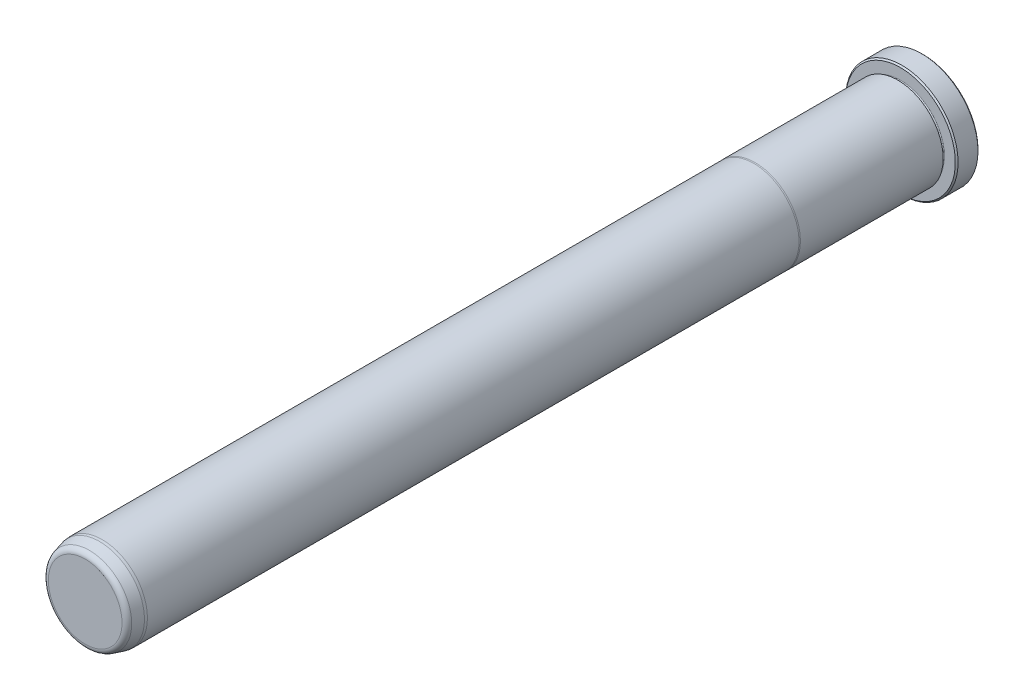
ISO-10303-21;
HEADER;
FILE_DESCRIPTION(('STEP AP214'),'2;1');
FILE_NAME('part.step','',(''),(''),'','','');
FILE_SCHEMA(('AUTOMOTIVE_DESIGN { 1 0 10303 214 1 1 1 1 }'));
ENDSEC;
DATA;
#1=APPLICATION_CONTEXT('core data for automotive mechanical design processes');
#2=APPLICATION_PROTOCOL_DEFINITION('international standard','automotive_design',2000,#1);
#3=PRODUCT_CONTEXT('',#1,'mechanical');
#4=PRODUCT('Part','Part','',(#3));
#5=PRODUCT_RELATED_PRODUCT_CATEGORY('part','',(#4));
#6=PRODUCT_DEFINITION_FORMATION('','',#4);
#7=PRODUCT_DEFINITION_CONTEXT('part definition',#1,'design');
#8=PRODUCT_DEFINITION('design','',#6,#7);
#9=PRODUCT_DEFINITION_SHAPE('','',#8);
#10=(LENGTH_UNIT() NAMED_UNIT(*) SI_UNIT(.MILLI.,.METRE.));
#11=(NAMED_UNIT(*) PLANE_ANGLE_UNIT() SI_UNIT($,.RADIAN.));
#12=(NAMED_UNIT(*) SI_UNIT($,.STERADIAN.) SOLID_ANGLE_UNIT());
#13=UNCERTAINTY_MEASURE_WITH_UNIT(LENGTH_MEASURE(1.E-05),#10,'distance_accuracy_value','');
#14=(GEOMETRIC_REPRESENTATION_CONTEXT(3) GLOBAL_UNCERTAINTY_ASSIGNED_CONTEXT((#13)) GLOBAL_UNIT_ASSIGNED_CONTEXT((#10,
#11,#12)) REPRESENTATION_CONTEXT('',''));
#15=CARTESIAN_POINT('',(0.,0.,0.));
#16=DIRECTION('',(0.,0.,1.));
#17=DIRECTION('',(1.,0.,0.));
#18=AXIS2_PLACEMENT_3D('',#15,#16,#17);
#19=CARTESIAN_POINT('',(0.,0.,0.));
#20=DIRECTION('',(0.,0.,1.));
#21=DIRECTION('',(1.,0.,0.));
#22=AXIS2_PLACEMENT_3D('',#19,#20,#21);
#23=PLANE('',#22);
#24=CARTESIAN_POINT('',(0.,0.,0.));
#25=DIRECTION('',(0.,0.,1.));
#26=DIRECTION('',(1.,0.,0.));
#27=AXIS2_PLACEMENT_3D('',#24,#25,#26);
#28=CIRCLE('',#27,15.367);
#29=CARTESIAN_POINT('',(15.367,0.,0.));
#30=VERTEX_POINT('',#29);
#31=EDGE_CURVE('E37',#30,#30,#28,.F.);
#32=ORIENTED_EDGE('',*,*,#31,.T.);
#33=EDGE_LOOP('',(#32));
#34=FACE_BOUND('',#33,.T.);
#35=ADVANCED_FACE('F30',(#34),#23,.F.);
#36=CARTESIAN_POINT('',(0.,0.,0.));
#37=DIRECTION('',(0.,0.,1.));
#38=DIRECTION('',(1.,0.,0.));
#39=AXIS2_PLACEMENT_3D('',#36,#37,#38);
#40=CYLINDRICAL_SURFACE('',#39,15.748);
#41=CARTESIAN_POINT('',(0.,0.,0.381000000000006));
#42=DIRECTION('',(0.,0.,1.));
#43=DIRECTION('',(1.,0.,0.));
#44=AXIS2_PLACEMENT_3D('',#41,#42,#43);
#45=CIRCLE('',#44,15.748);
#46=CARTESIAN_POINT('',(15.748,0.,0.381000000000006));
#47=VERTEX_POINT('',#46);
#48=EDGE_CURVE('E41',#47,#47,#45,.T.);
#49=ORIENTED_EDGE('',*,*,#48,.T.);
#50=EDGE_LOOP('',(#49));
#51=FACE_BOUND('',#50,.T.);
#52=CARTESIAN_POINT('',(0.,0.,5.96900000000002));
#53=DIRECTION('',(0.,0.,-1.));
#54=DIRECTION('',(-1.,0.,0.));
#55=AXIS2_PLACEMENT_3D('',#52,#53,#54);
#56=CIRCLE('',#55,15.748);
#57=CARTESIAN_POINT('',(-15.748,0.,5.96900000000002));
#58=VERTEX_POINT('',#57);
#59=EDGE_CURVE('E45',#58,#58,#56,.T.);
#60=ORIENTED_EDGE('',*,*,#59,.T.);
#61=EDGE_LOOP('',(#60));
#62=FACE_BOUND('',#61,.T.);
#63=ADVANCED_FACE('F118',(#51,#62),#40,.T.);
#64=CARTESIAN_POINT('',(0.,15.748,6.35));
#65=DIRECTION('',(0.,0.,-1.));
#66=DIRECTION('',(-1.,0.,0.));
#67=AXIS2_PLACEMENT_3D('',#64,#65,#66);
#68=PLANE('',#67);
#69=CARTESIAN_POINT('',(0.,0.,6.35));
#70=DIRECTION('',(0.,0.,-1.));
#71=DIRECTION('',(-1.,0.,0.));
#72=AXIS2_PLACEMENT_3D('',#69,#70,#71);
#73=CIRCLE('',#72,15.367);
#74=CARTESIAN_POINT('',(-15.367,0.,6.35));
#75=VERTEX_POINT('',#74);
#76=EDGE_CURVE('E10',#75,#75,#73,.F.);
#77=ORIENTED_EDGE('',*,*,#76,.T.);
#78=EDGE_LOOP('',(#77));
#79=FACE_BOUND('',#78,.T.);
#80=CARTESIAN_POINT('',(0.,0.,6.35));
#81=DIRECTION('',(0.,0.,1.));
#82=DIRECTION('',(1.,0.,0.));
#83=AXIS2_PLACEMENT_3D('',#80,#81,#82);
#84=CIRCLE('',#83,12.3063);
#85=CARTESIAN_POINT('',(12.3063,0.,6.35));
#86=VERTEX_POINT('',#85);
#87=EDGE_CURVE('E56',#86,#86,#84,.T.);
#88=ORIENTED_EDGE('',*,*,#87,.F.);
#89=EDGE_LOOP('',(#88));
#90=FACE_BOUND('',#89,.T.);
#91=ADVANCED_FACE('F113',(#79,#90),#68,.F.);
#92=CARTESIAN_POINT('',(0.,0.,6.731));
#93=DIRECTION('',(0.,0.,1.));
#94=DIRECTION('',(1.,0.,0.));
#95=AXIS2_PLACEMENT_3D('',#92,#93,#94);
#96=TOROIDAL_SURFACE('',#95,12.3063,0.381);
#97=CARTESIAN_POINT('',(0.,0.,7.112));
#98=DIRECTION('',(0.,0.,1.));
#99=DIRECTION('',(1.,0.,0.));
#100=AXIS2_PLACEMENT_3D('',#97,#98,#99);
#101=CIRCLE('',#100,12.3063);
#102=CARTESIAN_POINT('',(12.3063,0.,7.112));
#103=VERTEX_POINT('',#102);
#104=EDGE_CURVE('E59',#103,#103,#101,.T.);
#105=ORIENTED_EDGE('',*,*,#104,.F.);
#106=EDGE_LOOP('',(#105));
#107=FACE_BOUND('',#106,.T.);
#108=ORIENTED_EDGE('',*,*,#87,.T.);
#109=EDGE_LOOP('',(#108));
#110=FACE_BOUND('',#109,.T.);
#111=ADVANCED_FACE('F107',(#107,#110),#96,.F.);
#112=CARTESIAN_POINT('',(0.,12.3063,7.112));
#113=DIRECTION('',(0.,0.,1.));
#114=DIRECTION('',(1.,0.,0.));
#115=AXIS2_PLACEMENT_3D('',#112,#113,#114);
#116=PLANE('',#115);
#117=CARTESIAN_POINT('',(0.,0.,7.112));
#118=DIRECTION('',(0.,0.,1.));
#119=DIRECTION('',(1.,0.,0.));
#120=AXIS2_PLACEMENT_3D('',#117,#118,#119);
#121=CIRCLE('',#120,12.7127);
#122=CARTESIAN_POINT('',(12.7127,0.,7.112));
#123=VERTEX_POINT('',#122);
#124=EDGE_CURVE('E62',#123,#123,#121,.T.);
#125=ORIENTED_EDGE('',*,*,#124,.F.);
#126=EDGE_LOOP('',(#125));
#127=FACE_BOUND('',#126,.T.);
#128=ORIENTED_EDGE('',*,*,#104,.T.);
#129=EDGE_LOOP('',(#128));
#130=FACE_BOUND('',#129,.T.);
#131=ADVANCED_FACE('F101',(#127,#130),#116,.F.);
#132=CARTESIAN_POINT('',(0.,0.,0.));
#133=DIRECTION('',(0.,0.,1.));
#134=DIRECTION('',(1.,0.,0.));
#135=AXIS2_PLACEMENT_3D('',#132,#133,#134);
#136=CYLINDRICAL_SURFACE('',#135,12.7127);
#137=CARTESIAN_POINT('',(0.,0.,47.1347630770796));
#138=DIRECTION('',(0.,0.,1.));
#139=DIRECTION('',(1.,0.,0.));
#140=AXIS2_PLACEMENT_3D('',#137,#138,#139);
#141=CIRCLE('',#140,12.7127);
#142=CARTESIAN_POINT('',(12.7127,0.,47.1347630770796));
#143=VERTEX_POINT('',#142);
#144=EDGE_CURVE('E65',#143,#143,#141,.T.);
#145=ORIENTED_EDGE('',*,*,#144,.F.);
#146=EDGE_LOOP('',(#145));
#147=FACE_BOUND('',#146,.T.);
#148=ORIENTED_EDGE('',*,*,#124,.T.);
#149=EDGE_LOOP('',(#148));
#150=FACE_BOUND('',#149,.T.);
#151=ADVANCED_FACE('F95',(#147,#150),#136,.T.);
#152=CARTESIAN_POINT('',(0.,0.,47.1347630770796));
#153=DIRECTION('',(0.,0.,-1.));
#154=DIRECTION('',(-1.,0.,0.));
#155=AXIS2_PLACEMENT_3D('',#152,#153,#154);
#156=CONICAL_SURFACE('',#155,12.7127,0.0698131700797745);
#157=CARTESIAN_POINT('',(0.,0.,47.498));
#158=DIRECTION('',(0.,0.,1.));
#159=DIRECTION('',(1.,0.,0.));
#160=AXIS2_PLACEMENT_3D('',#157,#158,#159);
#161=CIRCLE('',#160,12.6873);
#162=CARTESIAN_POINT('',(12.6873,0.,47.498));
#163=VERTEX_POINT('',#162);
#164=EDGE_CURVE('E68',#163,#163,#161,.T.);
#165=ORIENTED_EDGE('',*,*,#164,.F.);
#166=EDGE_LOOP('',(#165));
#167=FACE_BOUND('',#166,.T.);
#168=ORIENTED_EDGE('',*,*,#144,.T.);
#169=EDGE_LOOP('',(#168));
#170=FACE_BOUND('',#169,.T.);
#171=ADVANCED_FACE('F89',(#167,#170),#156,.T.);
#172=CARTESIAN_POINT('',(0.,0.,0.));
#173=DIRECTION('',(0.,0.,1.));
#174=DIRECTION('',(1.,0.,0.));
#175=AXIS2_PLACEMENT_3D('',#172,#173,#174);
#176=CYLINDRICAL_SURFACE('',#175,12.6873);
#177=CARTESIAN_POINT('',(0.,0.,230.1875));
#178=DIRECTION('',(0.,0.,1.));
#179=DIRECTION('',(1.,0.,0.));
#180=AXIS2_PLACEMENT_3D('',#177,#178,#179);
#181=CIRCLE('',#180,12.6873);
#182=CARTESIAN_POINT('',(12.6873,0.,230.1875));
#183=VERTEX_POINT('',#182);
#184=EDGE_CURVE('E71',#183,#183,#181,.T.);
#185=ORIENTED_EDGE('',*,*,#184,.F.);
#186=EDGE_LOOP('',(#185));
#187=FACE_BOUND('',#186,.T.);
#188=ORIENTED_EDGE('',*,*,#164,.T.);
#189=EDGE_LOOP('',(#188));
#190=FACE_BOUND('',#189,.T.);
#191=ADVANCED_FACE('F83',(#187,#190),#176,.T.);
#192=CARTESIAN_POINT('',(0.,0.,230.1875));
#193=DIRECTION('',(0.,0.,-1.));
#194=DIRECTION('',(-1.,0.,0.));
#195=AXIS2_PLACEMENT_3D('',#192,#193,#194);
#196=CONICAL_SURFACE('',#195,12.6873,0.0872664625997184);
#197=CARTESIAN_POINT('',(0.,0.,230.9495));
#198=DIRECTION('',(0.,0.,1.));
#199=DIRECTION('',(1.,0.,0.));
#200=AXIS2_PLACEMENT_3D('',#197,#198,#199);
#201=CIRCLE('',#200,12.6206336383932);
#202=CARTESIAN_POINT('',(12.6206336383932,0.,230.9495));
#203=VERTEX_POINT('',#202);
#204=EDGE_CURVE('E74',#203,#203,#201,.T.);
#205=ORIENTED_EDGE('',*,*,#204,.F.);
#206=EDGE_LOOP('',(#205));
#207=FACE_BOUND('',#206,.T.);
#208=ORIENTED_EDGE('',*,*,#184,.T.);
#209=EDGE_LOOP('',(#208));
#210=FACE_BOUND('',#209,.T.);
#211=ADVANCED_FACE('F80',(#207,#210),#196,.T.);
#212=CARTESIAN_POINT('',(0.,0.,230.9495));
#213=DIRECTION('',(0.,0.,-1.));
#214=DIRECTION('',(-1.,0.,0.));
#215=AXIS2_PLACEMENT_3D('',#212,#213,#214);
#216=CONICAL_SURFACE('',#215,12.6206336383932,0.26179938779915);
#217=CARTESIAN_POINT('',(0.,0.,233.7733752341));
#218=DIRECTION('',(0.,0.,1.));
#219=DIRECTION('',(1.,0.,0.));
#220=AXIS2_PLACEMENT_3D('',#217,#218,#219);
#221=CIRCLE('',#220,11.8639785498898);
#222=CARTESIAN_POINT('',(11.8639785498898,0.,233.7733752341));
#223=VERTEX_POINT('',#222);
#224=EDGE_CURVE('E50',#223,#223,#221,.F.);
#225=ORIENTED_EDGE('',*,*,#224,.T.);
#226=EDGE_LOOP('',(#225));
#227=FACE_BOUND('',#226,.T.);
#228=ORIENTED_EDGE('',*,*,#204,.T.);
#229=EDGE_LOOP('',(#228));
#230=FACE_BOUND('',#229,.T.);
#231=ADVANCED_FACE('F78',(#227,#230),#216,.T.);
#232=CARTESIAN_POINT('',(0.,11.5487028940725,234.95));
#233=DIRECTION('',(0.,0.,-1.));
#234=DIRECTION('',(-1.,0.,0.));
#235=AXIS2_PLACEMENT_3D('',#232,#233,#234);
#236=PLANE('',#235);
#237=CARTESIAN_POINT('',(0.,0.,234.95));
#238=DIRECTION('',(0.,0.,-1.));
#239=DIRECTION('',(-1.,0.,0.));
#240=AXIS2_PLACEMENT_3D('',#237,#238,#239);
#241=CIRCLE('',#240,10.3305713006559);
#242=CARTESIAN_POINT('',(-10.3305713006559,0.,234.95));
#243=VERTEX_POINT('',#242);
#244=EDGE_CURVE('E53',#243,#243,#241,.F.);
#245=ORIENTED_EDGE('',*,*,#244,.T.);
#246=EDGE_LOOP('',(#245));
#247=FACE_BOUND('',#246,.T.);
#248=ADVANCED_FACE('F133',(#247),#236,.F.);
#249=CARTESIAN_POINT('',(0.,0.,233.3625));
#250=DIRECTION('',(0.,0.,-1.));
#251=DIRECTION('',(-1.,0.,0.));
#252=AXIS2_PLACEMENT_3D('',#249,#250,#251);
#253=TOROIDAL_SURFACE('',#252,10.3305713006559,1.5875);
#254=ORIENTED_EDGE('',*,*,#224,.F.);
#255=EDGE_LOOP('',(#254));
#256=FACE_BOUND('',#255,.T.);
#257=ORIENTED_EDGE('',*,*,#244,.F.);
#258=EDGE_LOOP('',(#257));
#259=FACE_BOUND('',#258,.T.);
#260=ADVANCED_FACE('F130',(#256,#259),#253,.T.);
#261=CARTESIAN_POINT('',(0.,0.,0.381000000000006));
#262=DIRECTION('',(0.,0.,1.));
#263=DIRECTION('',(1.,0.,0.));
#264=AXIS2_PLACEMENT_3D('',#261,#262,#263);
#265=CONICAL_SURFACE('',#264,15.748,0.785398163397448);
#266=CARTESIAN_POINT('',(15.367,0.,0.));
#267=CARTESIAN_POINT('',(15.37096875,0.,0.00396874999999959));
#268=CARTESIAN_POINT('',(15.3749375,0.,0.00793749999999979));
#269=CARTESIAN_POINT('',(15.382875,0.,0.0158750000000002));
#270=CARTESIAN_POINT('',(15.38684375,0.,0.0198437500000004));
#271=CARTESIAN_POINT('',(15.39478125,0.,0.0277812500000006));
#272=CARTESIAN_POINT('',(15.39875,0.,0.0317500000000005));
#273=CARTESIAN_POINT('',(15.4066875,0.,0.0396875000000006));
#274=CARTESIAN_POINT('',(15.41065625,0.,0.0436562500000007));
#275=CARTESIAN_POINT('',(15.41859375,0.,0.0515937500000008));
#276=CARTESIAN_POINT('',(15.4225625,0.,0.0555625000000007));
#277=CARTESIAN_POINT('',(15.4305,0.,0.0635000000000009));
#278=CARTESIAN_POINT('',(15.43446875,0.,0.0674687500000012));
#279=CARTESIAN_POINT('',(15.44240625,0.,0.0754062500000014));
#280=CARTESIAN_POINT('',(15.446375,0.,0.0793750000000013));
#281=CARTESIAN_POINT('',(15.4543125,0.,0.0873125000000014));
#282=CARTESIAN_POINT('',(15.45828125,0.,0.0912812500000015));
#283=CARTESIAN_POINT('',(15.46621875,0.,0.0992187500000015));
#284=CARTESIAN_POINT('',(15.4701875,0.,0.103187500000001));
#285=CARTESIAN_POINT('',(15.478125,0.,0.111125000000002));
#286=CARTESIAN_POINT('',(15.48209375,0.,0.115093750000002));
#287=CARTESIAN_POINT('',(15.49003125,0.,0.123031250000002));
#288=CARTESIAN_POINT('',(15.494,0.,0.127000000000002));
#289=CARTESIAN_POINT('',(15.5019375,0.,0.134937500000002));
#290=CARTESIAN_POINT('',(15.50590625,0.,0.138906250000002));
#291=CARTESIAN_POINT('',(15.51384375,0.,0.146843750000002));
#292=CARTESIAN_POINT('',(15.5178125,0.,0.150812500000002));
#293=CARTESIAN_POINT('',(15.52575,0.,0.158750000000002));
#294=CARTESIAN_POINT('',(15.52971875,0.,0.162718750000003));
#295=CARTESIAN_POINT('',(15.53765625,0.,0.170656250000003));
#296=CARTESIAN_POINT('',(15.541625,0.,0.174625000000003));
#297=CARTESIAN_POINT('',(15.5495625,0.,0.182562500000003));
#298=CARTESIAN_POINT('',(15.55353125,0.,0.186531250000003));
#299=CARTESIAN_POINT('',(15.56146875,0.,0.194468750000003));
#300=CARTESIAN_POINT('',(15.5654375,0.,0.198437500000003));
#301=CARTESIAN_POINT('',(15.573375,0.,0.206375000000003));
#302=CARTESIAN_POINT('',(15.57734375,0.,0.210343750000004));
#303=CARTESIAN_POINT('',(15.58528125,0.,0.218281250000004));
#304=CARTESIAN_POINT('',(15.58925,0.,0.222250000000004));
#305=CARTESIAN_POINT('',(15.5971875,0.,0.230187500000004));
#306=CARTESIAN_POINT('',(15.60115625,0.,0.234156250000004));
#307=CARTESIAN_POINT('',(15.60909375,0.,0.242093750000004));
#308=CARTESIAN_POINT('',(15.6130625,0.,0.246062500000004));
#309=CARTESIAN_POINT('',(15.621,0.,0.254000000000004));
#310=CARTESIAN_POINT('',(15.62496875,0.,0.257968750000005));
#311=CARTESIAN_POINT('',(15.63290625,0.,0.265906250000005));
#312=CARTESIAN_POINT('',(15.636875,0.,0.269875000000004));
#313=CARTESIAN_POINT('',(15.6448125,0.,0.277812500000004));
#314=CARTESIAN_POINT('',(15.64878125,0.,0.281781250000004));
#315=CARTESIAN_POINT('',(15.65671875,0.,0.289718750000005));
#316=CARTESIAN_POINT('',(15.6606875,0.,0.293687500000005));
#317=CARTESIAN_POINT('',(15.668625,0.,0.301625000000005));
#318=CARTESIAN_POINT('',(15.67259375,0.,0.305593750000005));
#319=CARTESIAN_POINT('',(15.68053125,0.,0.313531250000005));
#320=CARTESIAN_POINT('',(15.6845,0.,0.317500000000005));
#321=CARTESIAN_POINT('',(15.6924375,0.,0.325437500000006));
#322=CARTESIAN_POINT('',(15.69640625,0.,0.329406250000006));
#323=CARTESIAN_POINT('',(15.70434375,0.,0.337343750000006));
#324=CARTESIAN_POINT('',(15.7083125,0.,0.341312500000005));
#325=CARTESIAN_POINT('',(15.71625,0.,0.349250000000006));
#326=CARTESIAN_POINT('',(15.72021875,0.,0.353218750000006));
#327=CARTESIAN_POINT('',(15.72815625,0.,0.361156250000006));
#328=CARTESIAN_POINT('',(15.732125,0.,0.365125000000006));
#329=CARTESIAN_POINT('',(15.7400625,0.,0.373062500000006));
#330=CARTESIAN_POINT('',(15.74403125,0.,0.377031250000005));
#331=CARTESIAN_POINT('',(15.748,0.,0.381000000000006));
#332=B_SPLINE_CURVE_WITH_KNOTS('',3,(#266,#267,#268,#269,#270,#271,#272,#273,#274,#275,#276,
#277,#278,#279,#280,#281,#282,#283,#284,#285,#286,#287,#288,#289,#290,#291,#292,#293,#294,#295,
#296,#297,#298,#299,#300,#301,#302,#303,#304,#305,#306,#307,#308,#309,#310,#311,#312,#313,#314,
#315,#316,#317,#318,#319,#320,#321,#322,#323,#324,#325,#326,#327,#328,#329,#330,#331),
.UNSPECIFIED.,.F.,.F.,(4,2,2,2,2,2,2,2,2,2,2,2,2,2,2,2,2,2,2,2,2,2,2,2,2,2,2,2,2,2,2,2,4),(0.,
0.0168379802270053,0.0336759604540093,0.0505139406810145,0.0673519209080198,0.084189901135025,
0.101027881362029,0.117865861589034,0.13470384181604,0.151541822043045,0.168379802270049,
0.185217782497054,0.202055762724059,0.218893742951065,0.235731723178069,0.252569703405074,
0.269407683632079,0.286245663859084,0.303083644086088,0.319921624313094,0.336759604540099,
0.353597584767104,0.370435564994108,0.387273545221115,0.404111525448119,0.420949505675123,
0.437787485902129,0.454625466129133,0.471463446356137,0.488301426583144,0.505139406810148,
0.521977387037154,0.538815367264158),.UNSPECIFIED.);
#333=EDGE_CURVE('BSEAM132',#30,#47,#332,.T.);
#334=ORIENTED_EDGE('',*,*,#31,.F.);
#335=ORIENTED_EDGE('',*,*,#48,.F.);
#336=ORIENTED_EDGE('',*,*,#333,.T.);
#337=ORIENTED_EDGE('',*,*,#333,.F.);
#338=EDGE_LOOP('',(#334,#336,#335,#337));
#339=FACE_BOUND('',#338,.T.);
#340=ADVANCED_FACE('F132',(#339),#265,.T.);
#341=CARTESIAN_POINT('',(0.,0.,6.35));
#342=DIRECTION('',(0.,0.,-1.));
#343=DIRECTION('',(-1.,0.,0.));
#344=AXIS2_PLACEMENT_3D('',#341,#342,#343);
#345=CONICAL_SURFACE('',#344,15.367,0.785398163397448);
#346=ORIENTED_EDGE('',*,*,#59,.F.);
#347=EDGE_LOOP('',(#346));
#348=FACE_BOUND('',#347,.T.);
#349=ORIENTED_EDGE('',*,*,#76,.F.);
#350=EDGE_LOOP('',(#349));
#351=FACE_BOUND('',#350,.T.);
#352=ADVANCED_FACE('F32',(#348,#351),#345,.T.);
#353=CLOSED_SHELL('',(#35,#63,#91,#111,#131,#151,#171,#191,#211,#231,#248,#260,#340,#352));
#354=MANIFOLD_SOLID_BREP('B2',#353);
#355=ADVANCED_BREP_SHAPE_REPRESENTATION('',(#18,#354),#14);
#356=SHAPE_DEFINITION_REPRESENTATION(#9,#355);
ENDSEC;
END-ISO-10303-21;
